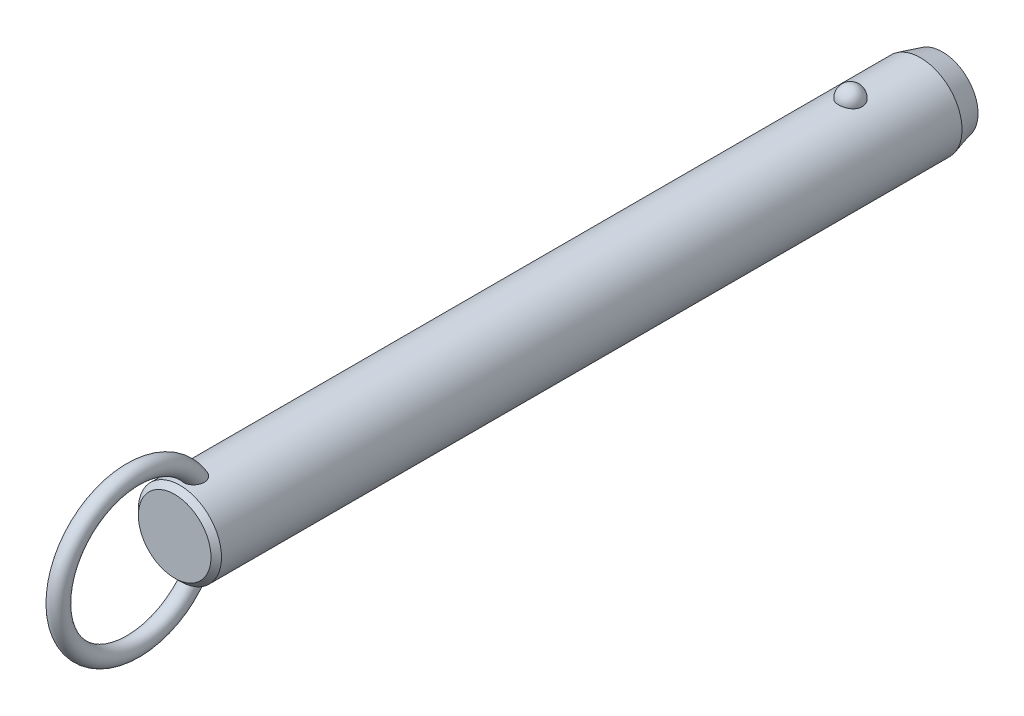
ISO-10303-21;
HEADER;
FILE_DESCRIPTION(('STEP AP214'),'2;1');
FILE_NAME('part.step','',(''),(''),'','','');
FILE_SCHEMA(('AUTOMOTIVE_DESIGN { 1 0 10303 214 1 1 1 1 }'));
ENDSEC;
DATA;
#1=APPLICATION_CONTEXT('core data for automotive mechanical design processes');
#2=APPLICATION_PROTOCOL_DEFINITION('international standard','automotive_design',2000,#1);
#3=PRODUCT_CONTEXT('',#1,'mechanical');
#4=PRODUCT('Part','Part','',(#3));
#5=PRODUCT_RELATED_PRODUCT_CATEGORY('part','',(#4));
#6=PRODUCT_DEFINITION_FORMATION('','',#4);
#7=PRODUCT_DEFINITION_CONTEXT('part definition',#1,'design');
#8=PRODUCT_DEFINITION('design','',#6,#7);
#9=PRODUCT_DEFINITION_SHAPE('','',#8);
#10=(LENGTH_UNIT() NAMED_UNIT(*) SI_UNIT(.MILLI.,.METRE.));
#11=(NAMED_UNIT(*) PLANE_ANGLE_UNIT() SI_UNIT($,.RADIAN.));
#12=(NAMED_UNIT(*) SI_UNIT($,.STERADIAN.) SOLID_ANGLE_UNIT());
#13=UNCERTAINTY_MEASURE_WITH_UNIT(LENGTH_MEASURE(1.E-05),#10,'distance_accuracy_value','');
#14=(GEOMETRIC_REPRESENTATION_CONTEXT(3) GLOBAL_UNCERTAINTY_ASSIGNED_CONTEXT((#13)) GLOBAL_UNIT_ASSIGNED_CONTEXT((#10,
#11,#12)) REPRESENTATION_CONTEXT('',''));
#15=CARTESIAN_POINT('',(0.,0.,0.));
#16=DIRECTION('',(0.,0.,1.));
#17=DIRECTION('',(1.,0.,0.));
#18=AXIS2_PLACEMENT_3D('',#15,#16,#17);
#19=CARTESIAN_POINT('',(0.,0.,142.2));
#20=DIRECTION('',(0.,0.,-1.));
#21=DIRECTION('',(-1.,0.,0.));
#22=AXIS2_PLACEMENT_3D('',#19,#20,#21);
#23=CYLINDRICAL_SURFACE('',#22,9.5);
#24=CARTESIAN_POINT('',(2.67259918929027,9.11631578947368,-2.70000000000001));
#25=CARTESIAN_POINT('',(2.6725968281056,9.11631786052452,-2.54909854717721));
#26=CARTESIAN_POINT('',(2.66030567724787,9.11994722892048,-2.39816735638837));
#27=CARTESIAN_POINT('',(2.6114347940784,9.13405924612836,-2.10058568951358));
#28=CARTESIAN_POINT('',(2.57484658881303,9.14454428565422,-1.95393672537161));
#29=CARTESIAN_POINT('',(2.47830875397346,9.17117631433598,-1.66916069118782));
#30=CARTESIAN_POINT('',(2.41836936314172,9.18732082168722,-1.53102991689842));
#31=CARTESIAN_POINT('',(2.27661331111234,9.22346780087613,-1.26705393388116));
#32=CARTESIAN_POINT('',(2.19479699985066,9.24347021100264,-1.14120852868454));
#33=CARTESIAN_POINT('',(2.01085282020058,9.28522401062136,-0.904632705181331));
#34=CARTESIAN_POINT('',(1.90862396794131,9.30698376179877,-0.793982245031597));
#35=CARTESIAN_POINT('',(1.6867437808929,9.34973971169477,-0.591607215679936));
#36=CARTESIAN_POINT('',(1.56709244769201,9.37073591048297,-0.499882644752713));
#37=CARTESIAN_POINT('',(1.31393976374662,9.40956370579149,-0.338167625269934));
#38=CARTESIAN_POINT('',(1.18048026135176,9.42740444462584,-0.268113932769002));
#39=CARTESIAN_POINT('',(0.903154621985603,9.45799906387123,-0.151390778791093));
#40=CARTESIAN_POINT('',(0.759289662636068,9.47075351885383,-0.104718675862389));
#41=CARTESIAN_POINT('',(0.468074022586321,9.48956256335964,-0.0367633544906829));
#42=CARTESIAN_POINT('',(0.320836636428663,9.49573643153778,-0.0150275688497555));
#43=CARTESIAN_POINT('',(0.0246714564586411,9.50112183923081,0.00396199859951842));
#44=CARTESIAN_POINT('',(-0.124256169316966,9.50033406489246,0.00121819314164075));
#45=CARTESIAN_POINT('',(-0.417264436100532,9.4919475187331,-0.0284441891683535));
#46=CARTESIAN_POINT('',(-0.56138413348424,9.48444885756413,-0.0550074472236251));
#47=CARTESIAN_POINT('',(-0.842986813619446,9.46357853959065,-0.131064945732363));
#48=CARTESIAN_POINT('',(-0.980469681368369,9.450206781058,-0.180559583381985));
#49=CARTESIAN_POINT('',(-1.24585005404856,9.41890822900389,-0.301476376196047));
#50=CARTESIAN_POINT('',(-1.37368611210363,9.40095498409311,-0.373026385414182));
#51=CARTESIAN_POINT('',(-1.61552738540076,9.36242964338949,-0.536025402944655));
#52=CARTESIAN_POINT('',(-1.72953116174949,9.34185727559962,-0.627476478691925));
#53=CARTESIAN_POINT('',(-1.9429225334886,9.29984568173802,-0.829844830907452));
#54=CARTESIAN_POINT('',(-2.04198021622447,9.27839736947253,-0.94110821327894));
#55=CARTESIAN_POINT('',(-2.22026460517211,9.23735994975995,-1.17883414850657));
#56=CARTESIAN_POINT('',(-2.29948985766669,9.21777097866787,-1.30529781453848));
#57=CARTESIAN_POINT('',(-2.43697287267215,9.18238994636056,-1.57158566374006));
#58=CARTESIAN_POINT('',(-2.49497068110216,9.16664569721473,-1.71155057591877));
#59=CARTESIAN_POINT('',(-2.5872073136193,9.14104303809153,-1.99961197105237));
#60=CARTESIAN_POINT('',(-2.62144683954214,9.13118445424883,-2.14770821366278));
#61=CARTESIAN_POINT('',(-2.66521466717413,9.11850622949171,-2.44715424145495));
#62=CARTESIAN_POINT('',(-2.67484831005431,9.11565658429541,-2.59848735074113));
#63=CARTESIAN_POINT('',(-2.66946735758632,9.11723375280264,-2.90067317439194));
#64=CARTESIAN_POINT('',(-2.65445345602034,9.12166036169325,-3.05152590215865));
#65=CARTESIAN_POINT('',(-2.60029711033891,9.13724422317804,-3.34766110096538));
#66=CARTESIAN_POINT('',(-2.56127978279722,9.14836656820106,-3.49296833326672));
#67=CARTESIAN_POINT('',(-2.46018844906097,9.17606676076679,-3.77477535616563));
#68=CARTESIAN_POINT('',(-2.39811349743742,9.1926448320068,-3.9112747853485));
#69=CARTESIAN_POINT('',(-2.25202303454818,9.22952198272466,-4.17244273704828));
#70=CARTESIAN_POINT('',(-2.16788714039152,9.24984129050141,-4.29704106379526));
#71=CARTESIAN_POINT('',(-1.9799408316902,9.29188255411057,-4.53013066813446));
#72=CARTESIAN_POINT('',(-1.87612963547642,9.31360456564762,-4.63862130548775));
#73=CARTESIAN_POINT('',(-1.65105429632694,9.35612959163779,-4.8369029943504));
#74=CARTESIAN_POINT('',(-1.52972405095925,9.37692871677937,-4.92661991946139));
#75=CARTESIAN_POINT('',(-1.27318250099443,9.41518970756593,-5.08429106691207));
#76=CARTESIAN_POINT('',(-1.13797219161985,9.432651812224,-5.15224684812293));
#77=CARTESIAN_POINT('',(-0.859280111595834,9.46208255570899,-5.26371827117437));
#78=CARTESIAN_POINT('',(-0.715925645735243,9.47411833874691,-5.30753421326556));
#79=CARTESIAN_POINT('',(-0.423550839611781,9.4916822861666,-5.37076321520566));
#80=CARTESIAN_POINT('',(-0.2745312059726,9.49721125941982,-5.39017930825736));
#81=CARTESIAN_POINT('',(0.0218446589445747,9.50110860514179,-5.40390587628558));
#82=CARTESIAN_POINT('',(0.16917707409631,9.49961381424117,-5.39869609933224));
#83=CARTESIAN_POINT('',(0.460808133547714,9.48993906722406,-5.36441955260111));
#84=CARTESIAN_POINT('',(0.605106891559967,9.48175936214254,-5.33535367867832));
#85=CARTESIAN_POINT('',(0.886027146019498,9.4596376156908,-5.25435587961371));
#86=CARTESIAN_POINT('',(1.02267710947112,9.44571881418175,-5.20251612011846));
#87=CARTESIAN_POINT('',(1.28523827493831,9.41358993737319,-5.07741549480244));
#88=CARTESIAN_POINT('',(1.41114877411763,9.39537958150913,-5.00415322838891));
#89=CARTESIAN_POINT('',(1.65085227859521,9.3562644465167,-4.83684599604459));
#90=CARTESIAN_POINT('',(1.76442346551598,9.33532178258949,-4.74249218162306));
#91=CARTESIAN_POINT('',(1.97425672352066,9.29321198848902,-4.53620389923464));
#92=CARTESIAN_POINT('',(2.07051582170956,9.27204482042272,-4.42426641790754));
#93=CARTESIAN_POINT('',(2.24490086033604,9.23139221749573,-4.18363183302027));
#94=CARTESIAN_POINT('',(2.32267019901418,9.21194380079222,-4.05466990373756));
#95=CARTESIAN_POINT('',(2.45584092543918,9.1773419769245,-3.78517836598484));
#96=CARTESIAN_POINT('',(2.5112497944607,9.16218713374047,-3.64465264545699));
#97=CARTESIAN_POINT('',(2.59380876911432,9.13913522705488,-3.37104301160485));
#98=CARTESIAN_POINT('',(2.62330266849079,9.13064624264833,-3.23871053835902));
#99=CARTESIAN_POINT('',(2.66269870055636,9.11923566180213,-2.97092664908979));
#100=CARTESIAN_POINT('',(2.67260130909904,9.11631393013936,-2.83547530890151));
#101=CARTESIAN_POINT('',(2.67259918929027,9.11631578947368,-2.70000000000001));
#102=B_SPLINE_CURVE_WITH_KNOTS('',3,(#24,#25,#26,#27,#28,#29,#30,#31,#32,#33,#34,#35,#36,#37,
#38,#39,#40,#41,#42,#43,#44,#45,#46,#47,#48,#49,#50,#51,#52,#53,#54,#55,#56,#57,#58,#59,#60,#61,
#62,#63,#64,#65,#66,#67,#68,#69,#70,#71,#72,#73,#74,#75,#76,#77,#78,#79,#80,#81,#82,#83,#84,#85,
#86,#87,#88,#89,#90,#91,#92,#93,#94,#95,#96,#97,#98,#99,#100,#101),.UNSPECIFIED.,.T.,.F.,(4,2,2,
2,2,2,2,2,2,2,2,2,2,2,2,2,2,2,2,2,2,2,2,2,2,2,2,2,2,2,2,2,2,2,2,2,2,2,4),(0.,0.452217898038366,
0.904593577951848,1.35677112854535,1.80894144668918,2.26340676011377,2.71787203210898,
3.17099820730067,3.62407318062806,4.0687883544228,4.51345969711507,4.95160616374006,
5.38976021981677,5.83050358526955,6.27129275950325,6.72071308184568,7.17016633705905,
7.62495278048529,8.07972578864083,8.53254856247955,8.98535859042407,9.43582813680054,
9.88631615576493,10.3393155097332,10.7923328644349,11.2471065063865,11.7018475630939,
12.150795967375,12.599688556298,13.0398725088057,13.4800399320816,13.9184421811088,
14.3568730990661,14.802202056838,15.2476074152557,15.7010097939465,16.1542603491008,
16.5602594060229,16.966248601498),.UNSPECIFIED.);
#103=CARTESIAN_POINT('',(2.67259918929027,9.11631578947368,-2.70000000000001));
#104=VERTEX_POINT('',#103);
#105=EDGE_CURVE('E41',#104,#104,#102,.T.);
#106=ORIENTED_EDGE('',*,*,#105,.T.);
#107=EDGE_LOOP('',(#106));
#108=FACE_BOUND('',#107,.T.);
#109=CARTESIAN_POINT('',(0.,0.,150.52));
#110=DIRECTION('',(0.,0.,1.));
#111=DIRECTION('',(1.,0.,0.));
#112=AXIS2_PLACEMENT_3D('',#109,#110,#111);
#113=CIRCLE('',#112,9.5);
#114=CARTESIAN_POINT('',(9.5,0.,150.52));
#115=VERTEX_POINT('',#114);
#116=EDGE_CURVE('E10',#115,#115,#113,.F.);
#117=ORIENTED_EDGE('',*,*,#116,.T.);
#118=EDGE_LOOP('',(#117));
#119=FACE_BOUND('',#118,.T.);
#120=CARTESIAN_POINT('',(-0.697062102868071,-9.47439269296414,144.867808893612));
#121=CARTESIAN_POINT('',(-0.799579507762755,-9.46685146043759,144.907482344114));
#122=CARTESIAN_POINT('',(-0.898575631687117,-9.45788043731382,144.9559309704));
#123=CARTESIAN_POINT('',(-1.08670047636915,-9.43811593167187,145.068868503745));
#124=CARTESIAN_POINT('',(-1.17583204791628,-9.42732297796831,145.133352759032));
#125=CARTESIAN_POINT('',(-1.34179806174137,-9.40513672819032,145.276209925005));
#126=CARTESIAN_POINT('',(-1.41865133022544,-9.39374438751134,145.354561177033));
#127=CARTESIAN_POINT('',(-1.55860047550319,-9.37154196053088,145.522752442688));
#128=CARTESIAN_POINT('',(-1.62169476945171,-9.3607319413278,145.61259377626));
#129=CARTESIAN_POINT('',(-1.73527695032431,-9.34035749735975,145.804500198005));
#130=CARTESIAN_POINT('',(-1.78522266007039,-9.33085270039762,145.906891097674));
#131=CARTESIAN_POINT('',(-1.86924997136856,-9.3143834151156,146.118148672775));
#132=CARTESIAN_POINT('',(-1.90332570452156,-9.30741986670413,146.227017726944));
#133=CARTESIAN_POINT('',(-1.95893603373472,-9.29588482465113,146.460473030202));
#134=CARTESIAN_POINT('',(-1.97872420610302,-9.29165182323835,146.585489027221));
#135=CARTESIAN_POINT('',(-2.00062129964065,-9.28695978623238,146.837080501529));
#136=CARTESIAN_POINT('',(-2.00272284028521,-9.28650232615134,146.963656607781));
#137=CARTESIAN_POINT('',(-1.98958876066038,-9.28932750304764,147.236815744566));
#138=CARTESIAN_POINT('',(-1.97143366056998,-9.2932400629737,147.383251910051));
#139=CARTESIAN_POINT('',(-1.91479925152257,-9.30507151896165,147.672062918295));
#140=CARTESIAN_POINT('',(-1.87629122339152,-9.31299607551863,147.814431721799));
#141=CARTESIAN_POINT('',(-1.77225683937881,-9.33340232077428,148.115172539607));
#142=CARTESIAN_POINT('',(-1.70334898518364,-9.34641636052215,148.272369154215));
#143=CARTESIAN_POINT('',(-1.58111062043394,-9.36759153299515,148.497517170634));
#144=CARTESIAN_POINT('',(-1.53721459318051,-9.37492619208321,148.570796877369));
#145=CARTESIAN_POINT('',(-1.4430263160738,-9.38988566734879,148.71307405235));
#146=CARTESIAN_POINT('',(-1.39273721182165,-9.39751033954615,148.782073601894));
#147=CARTESIAN_POINT('',(-1.26775962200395,-9.41530678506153,148.936983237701));
#148=CARTESIAN_POINT('',(-1.19052326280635,-9.42548108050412,149.020871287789));
#149=CARTESIAN_POINT('',(-1.02420241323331,-9.44499825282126,149.176008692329));
#150=CARTESIAN_POINT('',(-0.93513986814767,-9.45434261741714,149.247280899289));
#151=CARTESIAN_POINT('',(-0.766610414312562,-9.46930670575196,149.358695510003));
#152=CARTESIAN_POINT('',(-0.689439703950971,-9.47529223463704,149.402235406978));
#153=CARTESIAN_POINT('',(-0.528942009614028,-9.48560294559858,149.47631336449));
#154=CARTESIAN_POINT('',(-0.445620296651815,-9.48992953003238,149.506862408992));
#155=CARTESIAN_POINT('',(-0.273901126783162,-9.49644161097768,149.552579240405));
#156=CARTESIAN_POINT('',(-0.18546574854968,-9.49860811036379,149.56761059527));
#157=CARTESIAN_POINT('',(-0.00734541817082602,-9.5004135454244,149.580149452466));
#158=CARTESIAN_POINT('',(0.0823387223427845,-9.50005405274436,149.577667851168));
#159=CARTESIAN_POINT('',(0.24767927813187,-9.49708301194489,149.556995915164));
#160=CARTESIAN_POINT('',(0.323620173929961,-9.49477609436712,149.540930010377));
#161=CARTESIAN_POINT('',(0.471981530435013,-9.48855917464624,149.497172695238));
#162=CARTESIAN_POINT('',(0.544400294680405,-9.48464840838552,149.469475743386));
#163=CARTESIAN_POINT('',(0.708947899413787,-9.47398336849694,149.39280266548));
#164=CARTESIAN_POINT('',(0.799149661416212,-9.46671310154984,149.339774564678));
#165=CARTESIAN_POINT('',(0.969783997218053,-9.45076225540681,149.219973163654));
#166=CARTESIAN_POINT('',(1.050194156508,-9.44207854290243,149.153169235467));
#167=CARTESIAN_POINT('',(1.23092343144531,-9.42051459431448,148.980759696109));
#168=CARTESIAN_POINT('',(1.32652499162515,-9.40733378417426,148.87026193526));
#169=CARTESIAN_POINT('',(1.49893121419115,-9.38140745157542,148.635561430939));
#170=CARTESIAN_POINT('',(1.5757161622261,-9.36866239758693,148.511344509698));
#171=CARTESIAN_POINT('',(1.71285426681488,-9.34457644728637,148.249389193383));
#172=CARTESIAN_POINT('',(1.77266365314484,-9.33328726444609,148.11136233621));
#173=CARTESIAN_POINT('',(1.87239208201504,-9.31379209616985,147.828051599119));
#174=CARTESIAN_POINT('',(1.91230158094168,-9.3055875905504,147.682764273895));
#175=CARTESIAN_POINT('',(1.97604189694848,-9.29228394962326,147.362028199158));
#176=CARTESIAN_POINT('',(1.9958743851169,-9.28797202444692,147.185724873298));
#177=CARTESIAN_POINT('',(2.0029570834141,-9.28645519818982,146.832414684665));
#178=CARTESIAN_POINT('',(1.99025930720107,-9.28923895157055,146.655409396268));
#179=CARTESIAN_POINT('',(1.93735479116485,-9.30038134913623,146.356338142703));
#180=CARTESIAN_POINT('',(1.90576827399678,-9.30697680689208,146.232667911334));
#181=CARTESIAN_POINT('',(1.8228748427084,-9.32356855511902,145.992329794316));
#182=CARTESIAN_POINT('',(1.77158213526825,-9.33356239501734,145.875656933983));
#183=CARTESIAN_POINT('',(1.64885744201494,-9.35602275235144,145.652706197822));
#184=CARTESIAN_POINT('',(1.57730995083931,-9.36850332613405,145.546492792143));
#185=CARTESIAN_POINT('',(1.41543264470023,-9.39431873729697,145.349553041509));
#186=CARTESIAN_POINT('',(1.32510883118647,-9.40765330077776,145.258821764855));
#187=CARTESIAN_POINT('',(1.13846223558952,-9.43195720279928,145.105033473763));
#188=CARTESIAN_POINT('',(1.04369890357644,-9.44302894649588,145.040094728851));
#189=CARTESIAN_POINT('',(0.843965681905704,-9.46296805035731,144.928038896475));
#190=CARTESIAN_POINT('',(0.739000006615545,-9.47183631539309,144.880914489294));
#191=CARTESIAN_POINT('',(0.528175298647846,-9.48586140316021,144.808117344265));
#192=CARTESIAN_POINT('',(0.422686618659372,-9.49119633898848,144.78140249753));
#193=CARTESIAN_POINT('',(0.208590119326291,-9.49831365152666,144.746013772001));
#194=CARTESIAN_POINT('',(0.0999817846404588,-9.500095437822,144.737342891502));
#195=CARTESIAN_POINT('',(-0.126104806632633,-9.49988861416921,144.738350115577));
#196=CARTESIAN_POINT('',(-0.243578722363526,-9.49757821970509,144.749594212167));
#197=CARTESIAN_POINT('',(-0.474390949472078,-9.48885165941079,144.793167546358));
#198=CARTESIAN_POINT('',(-0.587729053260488,-9.48243528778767,144.825497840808));
#199=CARTESIAN_POINT('',(-0.697062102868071,-9.47439269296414,144.867808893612));
#200=B_SPLINE_CURVE_WITH_KNOTS('',3,(#120,#121,#122,#123,#124,#125,#126,#127,#128,#129,#130,
#131,#132,#133,#134,#135,#136,#137,#138,#139,#140,#141,#142,#143,#144,#145,#146,#147,#148,#149,
#150,#151,#152,#153,#154,#155,#156,#157,#158,#159,#160,#161,#162,#163,#164,#165,#166,#167,#168,
#169,#170,#171,#172,#173,#174,#175,#176,#177,#178,#179,#180,#181,#182,#183,#184,#185,#186,#187,
#188,#189,#190,#191,#192,#193,#194,#195,#196,#197,#198,#199),.UNSPECIFIED.,.T.,.F.,(4,2,2,2,2,2,
2,2,2,2,2,2,2,2,2,2,2,2,2,2,2,2,2,2,2,2,2,2,2,2,2,2,2,2,2,2,2,2,2,4),(0.,0.330119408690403,
0.660143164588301,0.989655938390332,1.31920659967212,1.66074728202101,2.00241415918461,
2.38088696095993,2.75951768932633,3.20065679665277,3.64242004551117,4.15620996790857,
4.4131416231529,4.66994734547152,5.01228664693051,5.35399933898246,5.61943037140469,
5.88463652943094,6.15215502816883,6.4195070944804,6.65144391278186,6.88349136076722,
7.19641200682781,7.51003602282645,7.94779711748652,8.3860149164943,8.83699707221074,
9.28819530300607,9.81778662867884,10.34653170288,10.7284172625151,11.1100280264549,
11.4938603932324,11.8775702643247,12.2220189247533,12.5663259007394,12.8915939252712,
13.2169159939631,13.5689650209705,13.9210316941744),.UNSPECIFIED.);
#201=CARTESIAN_POINT('',(-0.697062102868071,-9.47439269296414,144.867808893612));
#202=VERTEX_POINT('',#201);
#203=EDGE_CURVE('E59',#202,#202,#200,.T.);
#204=ORIENTED_EDGE('',*,*,#203,.T.);
#205=EDGE_LOOP('',(#204));
#206=FACE_BOUND('',#205,.T.);
#207=CARTESIAN_POINT('',(-0.697062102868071,9.47439269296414,144.867808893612));
#208=CARTESIAN_POINT('',(-0.597792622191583,9.48169483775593,144.82939564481));
#209=CARTESIAN_POINT('',(-0.495106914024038,9.48766580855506,144.799168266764));
#210=CARTESIAN_POINT('',(-0.285876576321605,9.49627648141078,144.756032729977));
#211=CARTESIAN_POINT('',(-0.179324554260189,9.49890941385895,144.743159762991));
#212=CARTESIAN_POINT('',(0.0344157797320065,9.50053798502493,144.735166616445));
#213=CARTESIAN_POINT('',(0.141603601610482,9.49953613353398,144.740034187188));
#214=CARTESIAN_POINT('',(0.35356357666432,9.49401038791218,144.767365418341));
#215=CARTESIAN_POINT('',(0.458336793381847,9.48948807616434,144.78982117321));
#216=CARTESIAN_POINT('',(0.662493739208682,9.4774236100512,144.851671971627));
#217=CARTESIAN_POINT('',(0.761881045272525,9.46988348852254,144.891055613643));
#218=CARTESIAN_POINT('',(0.952608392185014,9.45260382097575,144.985634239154));
#219=CARTESIAN_POINT('',(1.04394806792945,9.44286417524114,145.040829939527));
#220=CARTESIAN_POINT('',(1.21712767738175,9.42211760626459,145.166066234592));
#221=CARTESIAN_POINT('',(1.29885671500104,9.41109835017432,145.236257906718));
#222=CARTESIAN_POINT('',(1.44978975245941,9.38903310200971,145.388980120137));
#223=CARTESIAN_POINT('',(1.51899278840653,9.37798710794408,145.471511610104));
#224=CARTESIAN_POINT('',(1.64602857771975,9.35654375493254,145.649776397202));
#225=CARTESIAN_POINT('',(1.70333052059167,9.34618688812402,145.745891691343));
#226=CARTESIAN_POINT('',(1.80259341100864,9.32755128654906,145.945897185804));
#227=CARTESIAN_POINT('',(1.84454942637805,9.31927322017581,146.049789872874));
#228=CARTESIAN_POINT('',(1.91637039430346,9.30478365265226,146.272213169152));
#229=CARTESIAN_POINT('',(1.944805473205,9.29882552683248,146.391219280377));
#230=CARTESIAN_POINT('',(1.98449865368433,9.29043398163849,146.632143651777));
#231=CARTESIAN_POINT('',(1.99574908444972,9.28800213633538,146.754063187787));
#232=CARTESIAN_POINT('',(2.00275141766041,9.28649645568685,147.016932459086));
#233=CARTESIAN_POINT('',(1.99588238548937,9.28799035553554,147.157952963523));
#234=CARTESIAN_POINT('',(1.96270559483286,9.29505517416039,147.437621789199));
#235=CARTESIAN_POINT('',(1.93637872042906,9.30063010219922,147.576267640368));
#236=CARTESIAN_POINT('',(1.85949176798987,9.31633564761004,147.872561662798));
#237=CARTESIAN_POINT('',(1.80549792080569,9.3270926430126,148.029290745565));
#238=CARTESIAN_POINT('',(1.67376869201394,9.3516306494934,148.332284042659));
#239=CARTESIAN_POINT('',(1.59603181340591,9.36541185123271,148.478547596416));
#240=CARTESIAN_POINT('',(1.4360277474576,9.39110706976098,148.725813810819));
#241=CARTESIAN_POINT('',(1.35831795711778,9.40278656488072,148.829791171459));
#242=CARTESIAN_POINT('',(1.18774483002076,9.42585025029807,149.024534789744));
#243=CARTESIAN_POINT('',(1.09490932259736,9.43723493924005,149.115324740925));
#244=CARTESIAN_POINT('',(0.92111037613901,9.45552616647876,149.25620334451));
#245=CARTESIAN_POINT('',(0.84373824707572,9.46281058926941,149.310656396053));
#246=CARTESIAN_POINT('',(0.681245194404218,9.47589120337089,149.406711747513));
#247=CARTESIAN_POINT('',(0.596135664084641,9.48168953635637,149.448332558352));
#248=CARTESIAN_POINT('',(0.433779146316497,9.49038144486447,149.510089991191));
#249=CARTESIAN_POINT('',(0.357459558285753,9.49359170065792,149.53260136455));
#250=CARTESIAN_POINT('',(0.202074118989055,9.49816761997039,149.564574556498));
#251=CARTESIAN_POINT('',(0.123010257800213,9.49953459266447,149.574045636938));
#252=CARTESIAN_POINT('',(-0.03573724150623,9.50026497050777,149.579114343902));
#253=CARTESIAN_POINT('',(-0.115421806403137,9.49962433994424,149.574684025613));
#254=CARTESIAN_POINT('',(-0.272823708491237,9.49640854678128,149.552296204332));
#255=CARTESIAN_POINT('',(-0.350540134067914,9.4938325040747,149.534332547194));
#256=CARTESIAN_POINT('',(-0.500580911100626,9.48709462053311,149.486802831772));
#257=CARTESIAN_POINT('',(-0.572979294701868,9.48296359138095,149.457461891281));
#258=CARTESIAN_POINT('',(-0.712864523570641,9.47347609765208,149.389008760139));
#259=CARTESIAN_POINT('',(-0.780349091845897,9.46811906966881,149.349892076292));
#260=CARTESIAN_POINT('',(-0.946309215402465,9.45329720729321,149.239432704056));
#261=CARTESIAN_POINT('',(-1.04090230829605,9.44321512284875,149.162329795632));
#262=CARTESIAN_POINT('',(-1.21661929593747,9.42219227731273,148.99409718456));
#263=CARTESIAN_POINT('',(-1.29770519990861,9.41124921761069,148.902929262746));
#264=CARTESIAN_POINT('',(-1.47319646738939,9.38563439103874,148.676162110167));
#265=CARTESIAN_POINT('',(-1.5620887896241,9.37102009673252,148.536289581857));
#266=CARTESIAN_POINT('',(-1.71623987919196,9.34401559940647,148.243950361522));
#267=CARTESIAN_POINT('',(-1.78147866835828,9.33162728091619,148.091473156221));
#268=CARTESIAN_POINT('',(-1.88853837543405,9.31055541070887,147.775647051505));
#269=CARTESIAN_POINT('',(-1.92998995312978,9.30193076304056,147.612168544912));
#270=CARTESIAN_POINT('',(-1.98590726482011,9.29015757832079,147.280526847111));
#271=CARTESIAN_POINT('',(-2.0004070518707,9.2870021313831,147.112369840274));
#272=CARTESIAN_POINT('',(-1.99964701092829,9.28716218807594,146.805080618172));
#273=CARTESIAN_POINT('',(-1.98908145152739,9.28945704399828,146.665936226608));
#274=CARTESIAN_POINT('',(-1.94566294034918,9.29865169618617,146.391153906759));
#275=CARTESIAN_POINT('',(-1.9128206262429,9.30554929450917,146.255514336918));
#276=CARTESIAN_POINT('',(-1.84582133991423,9.31898248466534,146.057802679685));
#277=CARTESIAN_POINT('',(-1.82038084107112,9.32400364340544,145.992583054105));
#278=CARTESIAN_POINT('',(-1.76350511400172,9.33492884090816,145.864903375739));
#279=CARTESIAN_POINT('',(-1.73207305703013,9.34083241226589,145.802441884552));
#280=CARTESIAN_POINT('',(-1.66324243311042,9.35333332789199,145.68094078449));
#281=CARTESIAN_POINT('',(-1.62584239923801,9.35993084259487,145.621902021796));
#282=CARTESIAN_POINT('',(-1.54527678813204,9.37356864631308,145.507987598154));
#283=CARTESIAN_POINT('',(-1.50211241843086,9.38060884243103,145.453111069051));
#284=CARTESIAN_POINT('',(-1.37681147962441,9.40004442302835,145.309961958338));
#285=CARTESIAN_POINT('',(-1.28916358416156,9.41261047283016,145.226429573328));
#286=CARTESIAN_POINT('',(-1.09996826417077,9.43658180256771,145.077236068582));
#287=CARTESIAN_POINT('',(-0.998461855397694,9.44799034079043,145.011523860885));
#288=CARTESIAN_POINT('',(-0.860188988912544,9.46103017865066,144.9394367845));
#289=CARTESIAN_POINT('',(-0.828141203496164,9.46389141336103,144.923851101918));
#290=CARTESIAN_POINT('',(-0.763210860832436,9.46934915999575,144.894473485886));
#291=CARTESIAN_POINT('',(-0.730328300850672,9.47194567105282,144.880681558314));
#292=CARTESIAN_POINT('',(-0.697062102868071,9.47439269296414,144.867808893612));
#293=B_SPLINE_CURVE_WITH_KNOTS('',3,(#207,#208,#209,#210,#211,#212,#213,#214,#215,#216,#217,
#218,#219,#220,#221,#222,#223,#224,#225,#226,#227,#228,#229,#230,#231,#232,#233,#234,#235,#236,
#237,#238,#239,#240,#241,#242,#243,#244,#245,#246,#247,#248,#249,#250,#251,#252,#253,#254,#255,
#256,#257,#258,#259,#260,#261,#262,#263,#264,#265,#266,#267,#268,#269,#270,#271,#272,#273,#274,
#275,#276,#277,#278,#279,#280,#281,#282,#283,#284,#285,#286,#287,#288,#289,#290,#291,#292),
.UNSPECIFIED.,.T.,.F.,(4,2,2,2,2,2,2,2,2,2,2,2,2,2,2,2,2,2,2,2,2,2,2,2,2,2,2,2,2,2,2,2,2,2,2,2,
2,2,2,2,2,2,4),(0.,0.319942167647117,0.640532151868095,0.96090081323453,1.2811255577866,
1.60113495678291,1.92115886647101,2.24457323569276,2.56801248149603,2.90371927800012,
3.23953387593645,3.60560313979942,3.97183576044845,4.39383693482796,4.8162532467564,
5.31257045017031,5.80891895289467,6.19868344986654,6.58773876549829,6.87145417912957,
7.15475838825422,7.39263751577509,7.63034760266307,7.86853584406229,8.10683246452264,
8.3406366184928,8.57454843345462,8.93983939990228,9.30614105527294,9.80266668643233,
10.2996107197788,10.8040753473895,11.3079021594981,11.7249776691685,12.1418541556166,
12.3521485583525,12.5623319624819,12.7725671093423,12.9827582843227,13.345827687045,
13.7078449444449,13.8150604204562,13.9222762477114),.UNSPECIFIED.);
#294=CARTESIAN_POINT('',(-0.697062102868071,9.47439269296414,144.867808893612));
#295=VERTEX_POINT('',#294);
#296=EDGE_CURVE('E67',#295,#295,#293,.T.);
#297=ORIENTED_EDGE('',*,*,#296,.T.);
#298=EDGE_LOOP('',(#297));
#299=FACE_BOUND('',#298,.T.);
#300=CARTESIAN_POINT('',(0.,0.,-18.6999999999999));
#301=DIRECTION('',(0.,0.,-1.));
#302=DIRECTION('',(-1.,0.,0.));
#303=AXIS2_PLACEMENT_3D('',#300,#301,#302);
#304=CIRCLE('',#303,9.5);
#305=CARTESIAN_POINT('',(-9.5,0.,-18.6999999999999));
#306=VERTEX_POINT('',#305);
#307=EDGE_CURVE('E56',#306,#306,#304,.F.);
#308=ORIENTED_EDGE('',*,*,#307,.T.);
#309=EDGE_LOOP('',(#308));
#310=FACE_BOUND('',#309,.T.);
#311=ADVANCED_FACE('F37',(#108,#119,#206,#299,#310),#23,.T.);
#312=CARTESIAN_POINT('',(0.,0.,-23.7));
#313=DIRECTION('',(0.,0.,-1.));
#314=DIRECTION('',(-1.,0.,0.));
#315=AXIS2_PLACEMENT_3D('',#312,#313,#314);
#316=PLANE('',#315);
#317=CARTESIAN_POINT('',(0.,0.,-23.7));
#318=DIRECTION('',(0.,0.,-1.));
#319=DIRECTION('',(-1.,0.,0.));
#320=AXIS2_PLACEMENT_3D('',#317,#318,#319);
#321=CIRCLE('',#320,8.16025403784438);
#322=CARTESIAN_POINT('',(-8.16025403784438,0.,-23.7));
#323=VERTEX_POINT('',#322);
#324=EDGE_CURVE('E66',#323,#323,#321,.T.);
#325=ORIENTED_EDGE('',*,*,#324,.T.);
#326=EDGE_LOOP('',(#325));
#327=FACE_BOUND('',#326,.T.);
#328=ADVANCED_FACE('F85',(#327),#316,.T.);
#329=CARTESIAN_POINT('',(0.,0.,-23.7));
#330=DIRECTION('',(0.,0.,1.));
#331=DIRECTION('',(1.,0.,0.));
#332=AXIS2_PLACEMENT_3D('',#329,#330,#331);
#333=CONICAL_SURFACE('',#332,8.16025403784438,0.261799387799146);
#334=ORIENTED_EDGE('',*,*,#307,.F.);
#335=EDGE_LOOP('',(#334));
#336=FACE_BOUND('',#335,.T.);
#337=ORIENTED_EDGE('',*,*,#324,.F.);
#338=EDGE_LOOP('',(#337));
#339=FACE_BOUND('',#338,.T.);
#340=ADVANCED_FACE('F83',(#336,#339),#333,.T.);
#341=CARTESIAN_POINT('',(0.,0.,151.72));
#342=DIRECTION('',(0.,0.,1.));
#343=DIRECTION('',(1.,0.,0.));
#344=AXIS2_PLACEMENT_3D('',#341,#342,#343);
#345=PLANE('',#344);
#346=CARTESIAN_POINT('',(0.,0.,151.72));
#347=DIRECTION('',(0.,0.,1.));
#348=DIRECTION('',(1.,0.,0.));
#349=AXIS2_PLACEMENT_3D('',#346,#347,#348);
#350=CIRCLE('',#349,8.29999999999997);
#351=CARTESIAN_POINT('',(8.29999999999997,0.,151.72));
#352=VERTEX_POINT('',#351);
#353=EDGE_CURVE('E50',#352,#352,#350,.T.);
#354=ORIENTED_EDGE('',*,*,#353,.T.);
#355=EDGE_LOOP('',(#354));
#356=FACE_BOUND('',#355,.T.);
#357=ADVANCED_FACE('F77',(#356),#345,.T.);
#358=CARTESIAN_POINT('',(0.,0.,161.25));
#359=DIRECTION('',(1.,0.,0.));
#360=DIRECTION('',(0.,0.,-1.));
#361=AXIS2_PLACEMENT_3D('',#358,#359,#360);
#362=TOROIDAL_SURFACE('',#361,17.05,2.);
#363=ORIENTED_EDGE('',*,*,#296,.F.);
#364=EDGE_LOOP('',(#363));
#365=FACE_BOUND('',#364,.T.);
#366=ORIENTED_EDGE('',*,*,#203,.F.);
#367=EDGE_LOOP('',(#366));
#368=FACE_BOUND('',#367,.T.);
#369=ADVANCED_FACE('F73',(#365,#368),#362,.T.);
#370=CARTESIAN_POINT('',(0.,0.,151.72));
#371=DIRECTION('',(0.,0.,-1.));
#372=DIRECTION('',(-1.,0.,0.));
#373=AXIS2_PLACEMENT_3D('',#370,#371,#372);
#374=CONICAL_SURFACE('',#373,8.29999999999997,0.785398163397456);
#375=ORIENTED_EDGE('',*,*,#116,.F.);
#376=EDGE_LOOP('',(#375));
#377=FACE_BOUND('',#376,.T.);
#378=ORIENTED_EDGE('',*,*,#353,.F.);
#379=EDGE_LOOP('',(#378));
#380=FACE_BOUND('',#379,.T.);
#381=ADVANCED_FACE('F39',(#377,#380),#374,.T.);
#382=CARTESIAN_POINT('',(0.,9.5,-2.70000000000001));
#383=DIRECTION('',(0.,1.,0.));
#384=DIRECTION('',(0.,0.,-1.));
#385=AXIS2_PLACEMENT_3D('',#382,#383,#384);
#386=SPHERICAL_SURFACE('',#385,2.7);
#387=ORIENTED_EDGE('',*,*,#105,.F.);
#388=EDGE_LOOP('',(#387));
#389=FACE_BOUND('',#388,.T.);
#390=ADVANCED_FACE('F79',(#389),#386,.T.);
#391=CLOSED_SHELL('',(#311,#328,#340,#357,#369,#381,#390));
#392=MANIFOLD_SOLID_BREP('B2',#391);
#393=ADVANCED_BREP_SHAPE_REPRESENTATION('',(#18,#392),#14);
#394=SHAPE_DEFINITION_REPRESENTATION(#9,#393);
ENDSEC;
END-ISO-10303-21;
